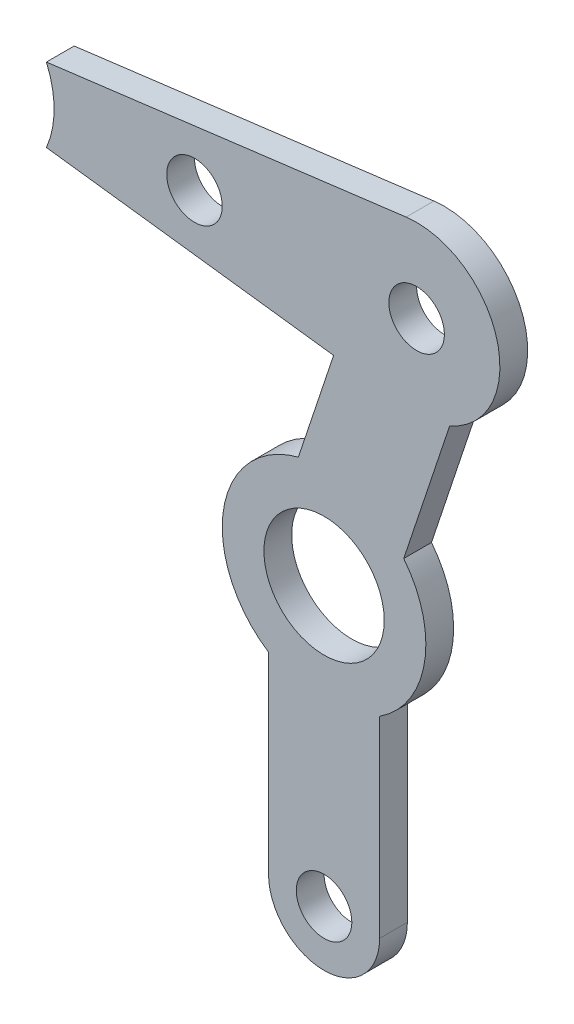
ISO-10303-21;
HEADER;
FILE_DESCRIPTION(('STEP AP214'),'2;1');
FILE_NAME('part.step','',(''),(''),'','','');
FILE_SCHEMA(('AUTOMOTIVE_DESIGN { 1 0 10303 214 1 1 1 1 }'));
ENDSEC;
DATA;
#1=APPLICATION_CONTEXT('core data for automotive mechanical design processes');
#2=APPLICATION_PROTOCOL_DEFINITION('international standard','automotive_design',2000,#1);
#3=PRODUCT_CONTEXT('',#1,'mechanical');
#4=PRODUCT('Part','Part','',(#3));
#5=PRODUCT_RELATED_PRODUCT_CATEGORY('part','',(#4));
#6=PRODUCT_DEFINITION_FORMATION('','',#4);
#7=PRODUCT_DEFINITION_CONTEXT('part definition',#1,'design');
#8=PRODUCT_DEFINITION('design','',#6,#7);
#9=PRODUCT_DEFINITION_SHAPE('','',#8);
#10=(LENGTH_UNIT() NAMED_UNIT(*) SI_UNIT(.MILLI.,.METRE.));
#11=(NAMED_UNIT(*) PLANE_ANGLE_UNIT() SI_UNIT($,.RADIAN.));
#12=(NAMED_UNIT(*) SI_UNIT($,.STERADIAN.) SOLID_ANGLE_UNIT());
#13=UNCERTAINTY_MEASURE_WITH_UNIT(LENGTH_MEASURE(1.E-05),#10,'distance_accuracy_value','');
#14=(GEOMETRIC_REPRESENTATION_CONTEXT(3) GLOBAL_UNCERTAINTY_ASSIGNED_CONTEXT((#13)) GLOBAL_UNIT_ASSIGNED_CONTEXT((#10,
#11,#12)) REPRESENTATION_CONTEXT('',''));
#15=CARTESIAN_POINT('',(0.,0.,0.));
#16=DIRECTION('',(0.,0.,1.));
#17=DIRECTION('',(1.,0.,0.));
#18=AXIS2_PLACEMENT_3D('',#15,#16,#17);
#19=CARTESIAN_POINT('',(0.,0.,1.5));
#20=DIRECTION('',(0.,0.,1.));
#21=DIRECTION('',(1.,0.,0.));
#22=AXIS2_PLACEMENT_3D('',#19,#20,#21);
#23=PLANE('',#22);
#24=CARTESIAN_POINT('',(-7.00000000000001,15.,1.5));
#25=DIRECTION('',(0.,0.,1.));
#26=DIRECTION('',(1.,0.,0.));
#27=AXIS2_PLACEMENT_3D('',#24,#25,#26);
#28=CIRCLE('',#27,1.5);
#29=CARTESIAN_POINT('',(-5.50000000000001,15.,1.5));
#30=VERTEX_POINT('',#29);
#31=EDGE_CURVE('E399',#30,#30,#28,.T.);
#32=ORIENTED_EDGE('',*,*,#31,.F.);
#33=EDGE_LOOP('',(#32));
#34=FACE_BOUND('',#33,.T.);
#35=CARTESIAN_POINT('',(0.,-15.,1.5));
#36=DIRECTION('',(0.,0.,1.));
#37=DIRECTION('',(1.,0.,0.));
#38=AXIS2_PLACEMENT_3D('',#35,#36,#37);
#39=CIRCLE('',#38,1.5);
#40=CARTESIAN_POINT('',(1.5,-15.,1.5));
#41=VERTEX_POINT('',#40);
#42=EDGE_CURVE('E401',#41,#41,#39,.T.);
#43=ORIENTED_EDGE('',*,*,#42,.F.);
#44=EDGE_LOOP('',(#43));
#45=FACE_BOUND('',#44,.T.);
#46=CARTESIAN_POINT('',(5.,15.,1.5));
#47=DIRECTION('',(0.,0.,1.));
#48=DIRECTION('',(1.,0.,0.));
#49=AXIS2_PLACEMENT_3D('',#46,#47,#48);
#50=CIRCLE('',#49,1.5);
#51=CARTESIAN_POINT('',(6.5,15.,1.5));
#52=VERTEX_POINT('',#51);
#53=EDGE_CURVE('E409',#52,#52,#50,.T.);
#54=ORIENTED_EDGE('',*,*,#53,.F.);
#55=EDGE_LOOP('',(#54));
#56=FACE_BOUND('',#55,.T.);
#57=DIRECTION('',(0.316227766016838,0.948683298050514,0.));
#58=VECTOR('',#57,1.);
#59=CARTESIAN_POINT('',(7.84604989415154,14.0513167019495,1.5));
#60=LINE('',#59,#58);
#61=CARTESIAN_POINT('',(4.30378786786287,3.42453062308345,1.5));
#62=VERTEX_POINT('',#61);
#63=CARTESIAN_POINT('',(6.78538972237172,10.8693361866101,1.5));
#64=VERTEX_POINT('',#63);
#65=EDGE_CURVE('E119',#62,#64,#60,.T.);
#66=ORIENTED_EDGE('',*,*,#65,.T.);
#67=CARTESIAN_POINT('',(5.,15.,1.5));
#68=DIRECTION('',(0.,0.,1.));
#69=DIRECTION('',(1.,0.,0.));
#70=AXIS2_PLACEMENT_3D('',#67,#68,#69);
#71=CIRCLE('',#70,4.5);
#72=CARTESIAN_POINT('',(4.43392535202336,19.4642535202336,1.5));
#73=VERTEX_POINT('',#72);
#74=EDGE_CURVE('E114',#64,#73,#71,.T.);
#75=ORIENTED_EDGE('',*,*,#74,.T.);
#76=DIRECTION('',(-0.99205633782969,-0.125794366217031,0.));
#77=VECTOR('',#76,1.);
#78=CARTESIAN_POINT('',(4.43392535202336,19.4642535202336,1.5));
#79=LINE('',#78,#77);
#80=CARTESIAN_POINT('',(-15.,17.,1.5));
#81=VERTEX_POINT('',#80);
#82=EDGE_CURVE('E118',#73,#81,#79,.T.);
#83=ORIENTED_EDGE('',*,*,#82,.T.);
#84=CARTESIAN_POINT('',(-19.5825756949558,15.,1.5));
#85=DIRECTION('',(0.,0.,-1.));
#86=DIRECTION('',(-1.,0.,0.));
#87=AXIS2_PLACEMENT_3D('',#84,#85,#86);
#88=CIRCLE('',#87,5.);
#89=CARTESIAN_POINT('',(-15.,13.,1.5));
#90=VERTEX_POINT('',#89);
#91=EDGE_CURVE('E136',#81,#90,#88,.T.);
#92=ORIENTED_EDGE('',*,*,#91,.T.);
#93=DIRECTION('',(0.99205633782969,-0.125794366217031,0.));
#94=VECTOR('',#93,1.);
#95=CARTESIAN_POINT('',(4.43392535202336,10.5357464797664,1.5));
#96=LINE('',#95,#94);
#97=CARTESIAN_POINT('',(0.515268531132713,11.0326385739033,1.5));
#98=VERTEX_POINT('',#97);
#99=EDGE_CURVE('E46',#90,#98,#96,.T.);
#100=ORIENTED_EDGE('',*,*,#99,.T.);
#101=DIRECTION('',(-0.316227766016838,-0.948683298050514,0.));
#102=VECTOR('',#101,1.);
#103=CARTESIAN_POINT('',(2.15395010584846,15.9486832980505,1.5));
#104=LINE('',#103,#102);
#105=CARTESIAN_POINT('',(-1.38831192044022,5.32189721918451,1.5));
#106=VERTEX_POINT('',#105);
#107=EDGE_CURVE('E177',#98,#106,#104,.T.);
#108=ORIENTED_EDGE('',*,*,#107,.T.);
#109=CARTESIAN_POINT('',(0.,0.,1.5));
#110=DIRECTION('',(0.,0.,1.));
#111=DIRECTION('',(1.,0.,0.));
#112=AXIS2_PLACEMENT_3D('',#109,#110,#111);
#113=CIRCLE('',#112,5.5);
#114=CARTESIAN_POINT('',(-3.,-4.60977222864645,1.5));
#115=VERTEX_POINT('',#114);
#116=EDGE_CURVE('E179',#106,#115,#113,.T.);
#117=ORIENTED_EDGE('',*,*,#116,.T.);
#118=DIRECTION('',(0.,-1.,0.));
#119=VECTOR('',#118,1.);
#120=CARTESIAN_POINT('',(-3.,-4.60977222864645,1.5));
#121=LINE('',#120,#119);
#122=CARTESIAN_POINT('',(-3.,-15.,1.5));
#123=VERTEX_POINT('',#122);
#124=EDGE_CURVE('E181',#115,#123,#121,.T.);
#125=ORIENTED_EDGE('',*,*,#124,.T.);
#126=CARTESIAN_POINT('',(0.,-15.,1.5));
#127=DIRECTION('',(0.,0.,1.));
#128=DIRECTION('',(1.,0.,0.));
#129=AXIS2_PLACEMENT_3D('',#126,#127,#128);
#130=CIRCLE('',#129,3.);
#131=CARTESIAN_POINT('',(3.,-15.,1.5));
#132=VERTEX_POINT('',#131);
#133=EDGE_CURVE('E183',#123,#132,#130,.T.);
#134=ORIENTED_EDGE('',*,*,#133,.T.);
#135=DIRECTION('',(0.,1.,0.));
#136=VECTOR('',#135,1.);
#137=CARTESIAN_POINT('',(3.,-15.,1.5));
#138=LINE('',#137,#136);
#139=CARTESIAN_POINT('',(3.,-4.60977222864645,1.5));
#140=VERTEX_POINT('',#139);
#141=EDGE_CURVE('E53',#132,#140,#138,.T.);
#142=ORIENTED_EDGE('',*,*,#141,.T.);
#143=CARTESIAN_POINT('',(0.,0.,1.5));
#144=DIRECTION('',(0.,0.,1.));
#145=DIRECTION('',(1.,0.,0.));
#146=AXIS2_PLACEMENT_3D('',#143,#144,#145);
#147=CIRCLE('',#146,5.5);
#148=EDGE_CURVE('E174',#140,#62,#147,.T.);
#149=ORIENTED_EDGE('',*,*,#148,.T.);
#150=EDGE_LOOP('',(#66,#75,#83,#92,#100,#108,#117,#125,#134,#142,#149));
#151=FACE_BOUND('',#150,.T.);
#152=CARTESIAN_POINT('',(0.,0.,1.5));
#153=DIRECTION('',(0.,0.,1.));
#154=DIRECTION('',(1.,0.,0.));
#155=AXIS2_PLACEMENT_3D('',#152,#153,#154);
#156=CIRCLE('',#155,3.25);
#157=CARTESIAN_POINT('',(3.25,0.,1.5));
#158=VERTEX_POINT('',#157);
#159=EDGE_CURVE('E155',#158,#158,#156,.T.);
#160=ORIENTED_EDGE('',*,*,#159,.F.);
#161=EDGE_LOOP('',(#160));
#162=FACE_BOUND('',#161,.T.);
#163=ADVANCED_FACE('F31',(#34,#45,#56,#151,#162),#23,.T.);
#164=CARTESIAN_POINT('',(0.,0.,0.));
#165=DIRECTION('',(0.,0.,1.));
#166=DIRECTION('',(1.,0.,0.));
#167=AXIS2_PLACEMENT_3D('',#164,#165,#166);
#168=PLANE('',#167);
#169=CARTESIAN_POINT('',(-7.00000000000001,15.,0.));
#170=DIRECTION('',(0.,0.,1.));
#171=DIRECTION('',(1.,0.,0.));
#172=AXIS2_PLACEMENT_3D('',#169,#170,#171);
#173=CIRCLE('',#172,1.5);
#174=CARTESIAN_POINT('',(-5.50000000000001,15.,0.));
#175=VERTEX_POINT('',#174);
#176=EDGE_CURVE('E397',#175,#175,#173,.T.);
#177=ORIENTED_EDGE('',*,*,#176,.T.);
#178=EDGE_LOOP('',(#177));
#179=FACE_BOUND('',#178,.T.);
#180=CARTESIAN_POINT('',(0.,-15.,0.));
#181=DIRECTION('',(0.,0.,1.));
#182=DIRECTION('',(1.,0.,0.));
#183=AXIS2_PLACEMENT_3D('',#180,#181,#182);
#184=CIRCLE('',#183,1.5);
#185=CARTESIAN_POINT('',(1.5,-15.,0.));
#186=VERTEX_POINT('',#185);
#187=EDGE_CURVE('E406',#186,#186,#184,.T.);
#188=ORIENTED_EDGE('',*,*,#187,.T.);
#189=EDGE_LOOP('',(#188));
#190=FACE_BOUND('',#189,.T.);
#191=CARTESIAN_POINT('',(5.,15.,0.));
#192=DIRECTION('',(0.,0.,1.));
#193=DIRECTION('',(1.,0.,0.));
#194=AXIS2_PLACEMENT_3D('',#191,#192,#193);
#195=CIRCLE('',#194,1.5);
#196=CARTESIAN_POINT('',(6.5,15.,0.));
#197=VERTEX_POINT('',#196);
#198=EDGE_CURVE('E121',#197,#197,#195,.T.);
#199=ORIENTED_EDGE('',*,*,#198,.T.);
#200=EDGE_LOOP('',(#199));
#201=FACE_BOUND('',#200,.T.);
#202=CARTESIAN_POINT('',(5.,15.,0.));
#203=DIRECTION('',(0.,0.,1.));
#204=DIRECTION('',(1.,0.,0.));
#205=AXIS2_PLACEMENT_3D('',#202,#203,#204);
#206=CIRCLE('',#205,4.5);
#207=CARTESIAN_POINT('',(6.78538972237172,10.8693361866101,0.));
#208=VERTEX_POINT('',#207);
#209=CARTESIAN_POINT('',(4.43392535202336,19.4642535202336,0.));
#210=VERTEX_POINT('',#209);
#211=EDGE_CURVE('E127',#208,#210,#206,.T.);
#212=ORIENTED_EDGE('',*,*,#211,.F.);
#213=DIRECTION('',(0.316227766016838,0.948683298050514,0.));
#214=VECTOR('',#213,1.);
#215=CARTESIAN_POINT('',(7.84604989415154,14.0513167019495,0.));
#216=LINE('',#215,#214);
#217=CARTESIAN_POINT('',(4.30378786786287,3.42453062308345,0.));
#218=VERTEX_POINT('',#217);
#219=EDGE_CURVE('E161',#218,#208,#216,.T.);
#220=ORIENTED_EDGE('',*,*,#219,.F.);
#221=CARTESIAN_POINT('',(0.,0.,0.));
#222=DIRECTION('',(0.,0.,1.));
#223=DIRECTION('',(1.,0.,0.));
#224=AXIS2_PLACEMENT_3D('',#221,#222,#223);
#225=CIRCLE('',#224,5.5);
#226=CARTESIAN_POINT('',(3.,-4.60977222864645,0.));
#227=VERTEX_POINT('',#226);
#228=EDGE_CURVE('E158',#227,#218,#225,.T.);
#229=ORIENTED_EDGE('',*,*,#228,.F.);
#230=DIRECTION('',(0.,1.,0.));
#231=VECTOR('',#230,1.);
#232=CARTESIAN_POINT('',(3.,-15.,0.));
#233=LINE('',#232,#231);
#234=CARTESIAN_POINT('',(3.,-15.,0.));
#235=VERTEX_POINT('',#234);
#236=EDGE_CURVE('E172',#235,#227,#233,.T.);
#237=ORIENTED_EDGE('',*,*,#236,.F.);
#238=CARTESIAN_POINT('',(0.,-15.,0.));
#239=DIRECTION('',(0.,0.,1.));
#240=DIRECTION('',(1.,0.,0.));
#241=AXIS2_PLACEMENT_3D('',#238,#239,#240);
#242=CIRCLE('',#241,3.);
#243=CARTESIAN_POINT('',(-3.,-15.,0.));
#244=VERTEX_POINT('',#243);
#245=EDGE_CURVE('E170',#244,#235,#242,.T.);
#246=ORIENTED_EDGE('',*,*,#245,.F.);
#247=DIRECTION('',(0.,-1.,0.));
#248=VECTOR('',#247,1.);
#249=CARTESIAN_POINT('',(-3.,-4.60977222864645,0.));
#250=LINE('',#249,#248);
#251=CARTESIAN_POINT('',(-3.,-4.60977222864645,0.));
#252=VERTEX_POINT('',#251);
#253=EDGE_CURVE('E168',#252,#244,#250,.T.);
#254=ORIENTED_EDGE('',*,*,#253,.F.);
#255=CARTESIAN_POINT('',(0.,0.,0.));
#256=DIRECTION('',(0.,0.,1.));
#257=DIRECTION('',(1.,0.,0.));
#258=AXIS2_PLACEMENT_3D('',#255,#256,#257);
#259=CIRCLE('',#258,5.5);
#260=CARTESIAN_POINT('',(-1.38831192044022,5.32189721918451,0.));
#261=VERTEX_POINT('',#260);
#262=EDGE_CURVE('E166',#261,#252,#259,.T.);
#263=ORIENTED_EDGE('',*,*,#262,.F.);
#264=DIRECTION('',(-0.316227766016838,-0.948683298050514,0.));
#265=VECTOR('',#264,1.);
#266=CARTESIAN_POINT('',(2.15395010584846,15.9486832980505,0.));
#267=LINE('',#266,#265);
#268=CARTESIAN_POINT('',(0.515268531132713,11.0326385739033,0.));
#269=VERTEX_POINT('',#268);
#270=EDGE_CURVE('E164',#269,#261,#267,.T.);
#271=ORIENTED_EDGE('',*,*,#270,.F.);
#272=DIRECTION('',(0.99205633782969,-0.125794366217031,0.));
#273=VECTOR('',#272,1.);
#274=CARTESIAN_POINT('',(4.43392535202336,10.5357464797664,0.));
#275=LINE('',#274,#273);
#276=CARTESIAN_POINT('',(-15.,13.,0.));
#277=VERTEX_POINT('',#276);
#278=EDGE_CURVE('E132',#277,#269,#275,.T.);
#279=ORIENTED_EDGE('',*,*,#278,.F.);
#280=CARTESIAN_POINT('',(-19.5825756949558,15.,0.));
#281=DIRECTION('',(0.,0.,-1.));
#282=DIRECTION('',(-1.,0.,0.));
#283=AXIS2_PLACEMENT_3D('',#280,#281,#282);
#284=CIRCLE('',#283,5.);
#285=CARTESIAN_POINT('',(-15.,17.,0.));
#286=VERTEX_POINT('',#285);
#287=EDGE_CURVE('E145',#286,#277,#284,.T.);
#288=ORIENTED_EDGE('',*,*,#287,.F.);
#289=DIRECTION('',(-0.99205633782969,-0.125794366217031,0.));
#290=VECTOR('',#289,1.);
#291=CARTESIAN_POINT('',(4.43392535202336,19.4642535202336,0.));
#292=LINE('',#291,#290);
#293=EDGE_CURVE('E143',#210,#286,#292,.T.);
#294=ORIENTED_EDGE('',*,*,#293,.F.);
#295=EDGE_LOOP('',(#212,#220,#229,#237,#246,#254,#263,#271,#279,#288,#294));
#296=FACE_BOUND('',#295,.T.);
#297=CARTESIAN_POINT('',(0.,0.,0.));
#298=DIRECTION('',(0.,0.,1.));
#299=DIRECTION('',(1.,0.,0.));
#300=AXIS2_PLACEMENT_3D('',#297,#298,#299);
#301=CIRCLE('',#300,3.25);
#302=CARTESIAN_POINT('',(3.25,0.,0.));
#303=VERTEX_POINT('',#302);
#304=EDGE_CURVE('E151',#303,#303,#301,.T.);
#305=ORIENTED_EDGE('',*,*,#304,.T.);
#306=EDGE_LOOP('',(#305));
#307=FACE_BOUND('',#306,.T.);
#308=ADVANCED_FACE('F213',(#179,#190,#201,#296,#307),#168,.F.);
#309=CARTESIAN_POINT('',(0.,0.,1.5));
#310=DIRECTION('',(0.,0.,-1.));
#311=DIRECTION('',(-1.,0.,0.));
#312=AXIS2_PLACEMENT_3D('',#309,#310,#311);
#313=CYLINDRICAL_SURFACE('',#312,5.5);
#314=ORIENTED_EDGE('',*,*,#228,.T.);
#315=DIRECTION('',(0.,0.,-1.));
#316=VECTOR('',#315,1.);
#317=CARTESIAN_POINT('',(4.30378786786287,3.42453062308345,1.5));
#318=LINE('',#317,#316);
#319=EDGE_CURVE('E201',#62,#218,#318,.T.);
#320=ORIENTED_EDGE('',*,*,#319,.F.);
#321=ORIENTED_EDGE('',*,*,#148,.F.);
#322=DIRECTION('',(0.,0.,-1.));
#323=VECTOR('',#322,1.);
#324=CARTESIAN_POINT('',(3.,-4.60977222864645,1.5));
#325=LINE('',#324,#323);
#326=EDGE_CURVE('E186',#140,#227,#325,.T.);
#327=ORIENTED_EDGE('',*,*,#326,.T.);
#328=EDGE_LOOP('',(#314,#320,#321,#327));
#329=FACE_BOUND('',#328,.T.);
#330=ADVANCED_FACE('F33',(#329),#313,.T.);
#331=CARTESIAN_POINT('',(7.84604989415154,14.0513167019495,1.5));
#332=DIRECTION('',(-0.948683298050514,0.316227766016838,0.));
#333=DIRECTION('',(-0.316227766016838,-0.948683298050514,0.));
#334=AXIS2_PLACEMENT_3D('',#331,#332,#333);
#335=PLANE('',#334);
#336=ORIENTED_EDGE('',*,*,#219,.T.);
#337=DIRECTION('',(0.,0.,1.));
#338=VECTOR('',#337,1.);
#339=CARTESIAN_POINT('',(6.78538972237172,10.8693361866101,0.));
#340=LINE('',#339,#338);
#341=EDGE_CURVE('E11',#208,#64,#340,.T.);
#342=ORIENTED_EDGE('',*,*,#341,.T.);
#343=ORIENTED_EDGE('',*,*,#65,.F.);
#344=ORIENTED_EDGE('',*,*,#319,.T.);
#345=EDGE_LOOP('',(#336,#342,#343,#344));
#346=FACE_BOUND('',#345,.T.);
#347=ADVANCED_FACE('F238',(#346),#335,.F.);
#348=CARTESIAN_POINT('',(2.15395010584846,15.9486832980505,1.5));
#349=DIRECTION('',(0.948683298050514,-0.316227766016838,0.));
#350=DIRECTION('',(0.316227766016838,0.948683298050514,0.));
#351=AXIS2_PLACEMENT_3D('',#348,#349,#350);
#352=PLANE('',#351);
#353=ORIENTED_EDGE('',*,*,#107,.F.);
#354=DIRECTION('',(0.,0.,-1.));
#355=VECTOR('',#354,1.);
#356=CARTESIAN_POINT('',(0.515268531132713,11.0326385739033,1.5));
#357=LINE('',#356,#355);
#358=EDGE_CURVE('E39',#98,#269,#357,.T.);
#359=ORIENTED_EDGE('',*,*,#358,.T.);
#360=ORIENTED_EDGE('',*,*,#270,.T.);
#361=DIRECTION('',(0.,0.,-1.));
#362=VECTOR('',#361,1.);
#363=CARTESIAN_POINT('',(-1.38831192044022,5.32189721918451,1.5));
#364=LINE('',#363,#362);
#365=EDGE_CURVE('E198',#106,#261,#364,.T.);
#366=ORIENTED_EDGE('',*,*,#365,.F.);
#367=EDGE_LOOP('',(#353,#359,#360,#366));
#368=FACE_BOUND('',#367,.T.);
#369=ADVANCED_FACE('F207',(#368),#352,.F.);
#370=CARTESIAN_POINT('',(0.,0.,1.5));
#371=DIRECTION('',(0.,0.,-1.));
#372=DIRECTION('',(-1.,0.,0.));
#373=AXIS2_PLACEMENT_3D('',#370,#371,#372);
#374=CYLINDRICAL_SURFACE('',#373,5.5);
#375=ORIENTED_EDGE('',*,*,#262,.T.);
#376=DIRECTION('',(0.,0.,-1.));
#377=VECTOR('',#376,1.);
#378=CARTESIAN_POINT('',(-3.,-4.60977222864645,1.5));
#379=LINE('',#378,#377);
#380=EDGE_CURVE('E195',#115,#252,#379,.T.);
#381=ORIENTED_EDGE('',*,*,#380,.F.);
#382=ORIENTED_EDGE('',*,*,#116,.F.);
#383=ORIENTED_EDGE('',*,*,#365,.T.);
#384=EDGE_LOOP('',(#375,#381,#382,#383));
#385=FACE_BOUND('',#384,.T.);
#386=ADVANCED_FACE('F220',(#385),#374,.T.);
#387=CARTESIAN_POINT('',(-3.,-4.60977222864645,1.5));
#388=DIRECTION('',(1.,0.,0.));
#389=DIRECTION('',(0.,1.,0.));
#390=AXIS2_PLACEMENT_3D('',#387,#388,#389);
#391=PLANE('',#390);
#392=ORIENTED_EDGE('',*,*,#253,.T.);
#393=DIRECTION('',(0.,0.,-1.));
#394=VECTOR('',#393,1.);
#395=CARTESIAN_POINT('',(-3.,-15.,1.5));
#396=LINE('',#395,#394);
#397=EDGE_CURVE('E192',#123,#244,#396,.T.);
#398=ORIENTED_EDGE('',*,*,#397,.F.);
#399=ORIENTED_EDGE('',*,*,#124,.F.);
#400=ORIENTED_EDGE('',*,*,#380,.T.);
#401=EDGE_LOOP('',(#392,#398,#399,#400));
#402=FACE_BOUND('',#401,.T.);
#403=ADVANCED_FACE('F224',(#402),#391,.F.);
#404=CARTESIAN_POINT('',(0.,-15.,1.5));
#405=DIRECTION('',(0.,0.,-1.));
#406=DIRECTION('',(-1.,0.,0.));
#407=AXIS2_PLACEMENT_3D('',#404,#405,#406);
#408=CYLINDRICAL_SURFACE('',#407,3.);
#409=ORIENTED_EDGE('',*,*,#245,.T.);
#410=DIRECTION('',(0.,0.,-1.));
#411=VECTOR('',#410,1.);
#412=CARTESIAN_POINT('',(3.,-15.,1.5));
#413=LINE('',#412,#411);
#414=EDGE_CURVE('E189',#132,#235,#413,.T.);
#415=ORIENTED_EDGE('',*,*,#414,.F.);
#416=ORIENTED_EDGE('',*,*,#133,.F.);
#417=ORIENTED_EDGE('',*,*,#397,.T.);
#418=EDGE_LOOP('',(#409,#415,#416,#417));
#419=FACE_BOUND('',#418,.T.);
#420=ADVANCED_FACE('F229',(#419),#408,.T.);
#421=CARTESIAN_POINT('',(3.,-15.,1.5));
#422=DIRECTION('',(-1.,0.,0.));
#423=DIRECTION('',(0.,0.,1.));
#424=AXIS2_PLACEMENT_3D('',#421,#422,#423);
#425=PLANE('',#424);
#426=ORIENTED_EDGE('',*,*,#236,.T.);
#427=ORIENTED_EDGE('',*,*,#326,.F.);
#428=ORIENTED_EDGE('',*,*,#141,.F.);
#429=ORIENTED_EDGE('',*,*,#414,.T.);
#430=EDGE_LOOP('',(#426,#427,#428,#429));
#431=FACE_BOUND('',#430,.T.);
#432=ADVANCED_FACE('F232',(#431),#425,.F.);
#433=CARTESIAN_POINT('',(0.,0.,1.5));
#434=DIRECTION('',(0.,0.,-1.));
#435=DIRECTION('',(-1.,0.,0.));
#436=AXIS2_PLACEMENT_3D('',#433,#434,#435);
#437=CYLINDRICAL_SURFACE('',#436,3.25);
#438=ORIENTED_EDGE('',*,*,#159,.T.);
#439=EDGE_LOOP('',(#438));
#440=FACE_BOUND('',#439,.T.);
#441=ORIENTED_EDGE('',*,*,#304,.F.);
#442=EDGE_LOOP('',(#441));
#443=FACE_BOUND('',#442,.T.);
#444=ADVANCED_FACE('F249',(#440,#443),#437,.F.);
#445=CARTESIAN_POINT('',(5.,15.,0.));
#446=DIRECTION('',(0.,0.,1.));
#447=DIRECTION('',(1.,0.,0.));
#448=AXIS2_PLACEMENT_3D('',#445,#446,#447);
#449=CYLINDRICAL_SURFACE('',#448,4.5);
#450=ORIENTED_EDGE('',*,*,#341,.F.);
#451=ORIENTED_EDGE('',*,*,#211,.T.);
#452=DIRECTION('',(0.,0.,1.));
#453=VECTOR('',#452,1.);
#454=CARTESIAN_POINT('',(4.43392535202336,19.4642535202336,0.));
#455=LINE('',#454,#453);
#456=EDGE_CURVE('E124',#210,#73,#455,.T.);
#457=ORIENTED_EDGE('',*,*,#456,.T.);
#458=ORIENTED_EDGE('',*,*,#74,.F.);
#459=EDGE_LOOP('',(#450,#451,#457,#458));
#460=FACE_BOUND('',#459,.T.);
#461=ADVANCED_FACE('F125',(#460),#449,.T.);
#462=CARTESIAN_POINT('',(4.43392535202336,10.5357464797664,0.));
#463=DIRECTION('',(-0.125794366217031,-0.99205633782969,0.));
#464=DIRECTION('',(0.99205633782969,-0.125794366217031,0.));
#465=AXIS2_PLACEMENT_3D('',#462,#463,#464);
#466=PLANE('',#465);
#467=ORIENTED_EDGE('',*,*,#358,.F.);
#468=ORIENTED_EDGE('',*,*,#99,.F.);
#469=DIRECTION('',(0.,0.,1.));
#470=VECTOR('',#469,1.);
#471=CARTESIAN_POINT('',(-15.,13.,0.));
#472=LINE('',#471,#470);
#473=EDGE_CURVE('E149',#277,#90,#472,.T.);
#474=ORIENTED_EDGE('',*,*,#473,.F.);
#475=ORIENTED_EDGE('',*,*,#278,.T.);
#476=EDGE_LOOP('',(#467,#468,#474,#475));
#477=FACE_BOUND('',#476,.T.);
#478=ADVANCED_FACE('F241',(#477),#466,.T.);
#479=CARTESIAN_POINT('',(-19.5825756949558,15.,0.));
#480=DIRECTION('',(0.,0.,1.));
#481=DIRECTION('',(1.,0.,0.));
#482=AXIS2_PLACEMENT_3D('',#479,#480,#481);
#483=CYLINDRICAL_SURFACE('',#482,5.);
#484=ORIENTED_EDGE('',*,*,#91,.F.);
#485=DIRECTION('',(0.,0.,1.));
#486=VECTOR('',#485,1.);
#487=CARTESIAN_POINT('',(-15.,17.,0.));
#488=LINE('',#487,#486);
#489=EDGE_CURVE('E131',#286,#81,#488,.T.);
#490=ORIENTED_EDGE('',*,*,#489,.F.);
#491=ORIENTED_EDGE('',*,*,#287,.T.);
#492=ORIENTED_EDGE('',*,*,#473,.T.);
#493=EDGE_LOOP('',(#484,#490,#491,#492));
#494=FACE_BOUND('',#493,.T.);
#495=ADVANCED_FACE('F240',(#494),#483,.F.);
#496=CARTESIAN_POINT('',(4.43392535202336,19.4642535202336,0.));
#497=DIRECTION('',(-0.125794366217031,0.99205633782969,0.));
#498=DIRECTION('',(-0.99205633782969,-0.125794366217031,0.));
#499=AXIS2_PLACEMENT_3D('',#496,#497,#498);
#500=PLANE('',#499);
#501=ORIENTED_EDGE('',*,*,#82,.F.);
#502=ORIENTED_EDGE('',*,*,#456,.F.);
#503=ORIENTED_EDGE('',*,*,#293,.T.);
#504=ORIENTED_EDGE('',*,*,#489,.T.);
#505=EDGE_LOOP('',(#501,#502,#503,#504));
#506=FACE_BOUND('',#505,.T.);
#507=ADVANCED_FACE('F134',(#506),#500,.T.);
#508=CARTESIAN_POINT('',(5.,15.,0.));
#509=DIRECTION('',(0.,0.,1.));
#510=DIRECTION('',(1.,0.,0.));
#511=AXIS2_PLACEMENT_3D('',#508,#509,#510);
#512=CYLINDRICAL_SURFACE('',#511,1.5);
#513=ORIENTED_EDGE('',*,*,#198,.F.);
#514=EDGE_LOOP('',(#513));
#515=FACE_BOUND('',#514,.T.);
#516=ORIENTED_EDGE('',*,*,#53,.T.);
#517=EDGE_LOOP('',(#516));
#518=FACE_BOUND('',#517,.T.);
#519=ADVANCED_FACE('F362',(#515,#518),#512,.F.);
#520=CARTESIAN_POINT('',(0.,-15.,0.));
#521=DIRECTION('',(0.,0.,1.));
#522=DIRECTION('',(1.,0.,0.));
#523=AXIS2_PLACEMENT_3D('',#520,#521,#522);
#524=CYLINDRICAL_SURFACE('',#523,1.5);
#525=ORIENTED_EDGE('',*,*,#187,.F.);
#526=EDGE_LOOP('',(#525));
#527=FACE_BOUND('',#526,.T.);
#528=ORIENTED_EDGE('',*,*,#42,.T.);
#529=EDGE_LOOP('',(#528));
#530=FACE_BOUND('',#529,.T.);
#531=ADVANCED_FACE('F371',(#527,#530),#524,.F.);
#532=CARTESIAN_POINT('',(-7.00000000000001,15.,0.));
#533=DIRECTION('',(0.,0.,1.));
#534=DIRECTION('',(1.,0.,0.));
#535=AXIS2_PLACEMENT_3D('',#532,#533,#534);
#536=CYLINDRICAL_SURFACE('',#535,1.5);
#537=ORIENTED_EDGE('',*,*,#176,.F.);
#538=EDGE_LOOP('',(#537));
#539=FACE_BOUND('',#538,.T.);
#540=ORIENTED_EDGE('',*,*,#31,.T.);
#541=EDGE_LOOP('',(#540));
#542=FACE_BOUND('',#541,.T.);
#543=ADVANCED_FACE('F380',(#539,#542),#536,.F.);
#544=CLOSED_SHELL('',(#163,#308,#330,#347,#369,#386,#403,#420,#432,#444,#461,#478,#495,#507,
#519,#531,#543));
#545=MANIFOLD_SOLID_BREP('B2',#544);
#546=ADVANCED_BREP_SHAPE_REPRESENTATION('',(#18,#545),#14);
#547=SHAPE_DEFINITION_REPRESENTATION(#9,#546);
ENDSEC;
END-ISO-10303-21;
